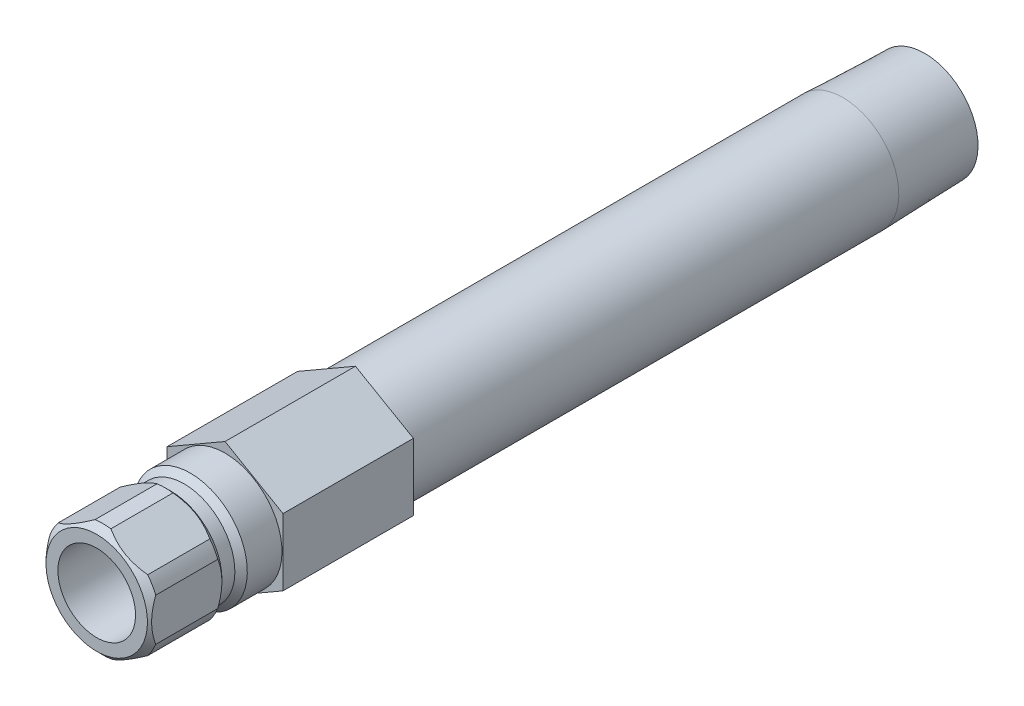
ISO-10303-21;
HEADER;
FILE_DESCRIPTION(('STEP AP214'),'2;1');
FILE_NAME('part.step','',(''),(''),'','','');
FILE_SCHEMA(('AUTOMOTIVE_DESIGN { 1 0 10303 214 1 1 1 1 }'));
ENDSEC;
DATA;
#1=APPLICATION_CONTEXT('core data for automotive mechanical design processes');
#2=APPLICATION_PROTOCOL_DEFINITION('international standard','automotive_design',2000,#1);
#3=PRODUCT_CONTEXT('',#1,'mechanical');
#4=PRODUCT('Part','Part','',(#3));
#5=PRODUCT_RELATED_PRODUCT_CATEGORY('part','',(#4));
#6=PRODUCT_DEFINITION_FORMATION('','',#4);
#7=PRODUCT_DEFINITION_CONTEXT('part definition',#1,'design');
#8=PRODUCT_DEFINITION('design','',#6,#7);
#9=PRODUCT_DEFINITION_SHAPE('','',#8);
#10=(LENGTH_UNIT() NAMED_UNIT(*) SI_UNIT(.MILLI.,.METRE.));
#11=(NAMED_UNIT(*) PLANE_ANGLE_UNIT() SI_UNIT($,.RADIAN.));
#12=(NAMED_UNIT(*) SI_UNIT($,.STERADIAN.) SOLID_ANGLE_UNIT());
#13=UNCERTAINTY_MEASURE_WITH_UNIT(LENGTH_MEASURE(1.E-05),#10,'distance_accuracy_value','');
#14=(GEOMETRIC_REPRESENTATION_CONTEXT(3) GLOBAL_UNCERTAINTY_ASSIGNED_CONTEXT((#13)) GLOBAL_UNIT_ASSIGNED_CONTEXT((#10,
#11,#12)) REPRESENTATION_CONTEXT('',''));
#15=CARTESIAN_POINT('',(0.,0.,0.));
#16=DIRECTION('',(0.,0.,1.));
#17=DIRECTION('',(1.,0.,0.));
#18=AXIS2_PLACEMENT_3D('',#15,#16,#17);
#19=CARTESIAN_POINT('',(0.,0.,12.8748331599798));
#20=DIRECTION('',(0.,0.,-1.));
#21=DIRECTION('',(0.,1.,0.));
#22=AXIS2_PLACEMENT_3D('',#19,#20,#21);
#23=CYLINDRICAL_SURFACE('',#22,6.985);
#24=DIRECTION('',(0.,0.,-1.));
#25=VECTOR('',#24,1.);
#26=CARTESIAN_POINT('',(5.50323442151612,-4.30170151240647,12.8748331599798));
#27=LINE('',#26,#25);
#28=CARTESIAN_POINT('',(5.50323442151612,-4.30170151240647,7.366));
#29=VERTEX_POINT('',#28);
#30=CARTESIAN_POINT('',(5.50323442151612,-4.30170151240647,14.986));
#31=VERTEX_POINT('',#30);
#32=EDGE_CURVE('E452',#29,#31,#27,.F.);
#33=ORIENTED_EDGE('',*,*,#32,.F.);
#34=CARTESIAN_POINT('',(0.,0.,7.366));
#35=DIRECTION('',(0.,0.,-1.));
#36=DIRECTION('',(0.,1.,0.));
#37=AXIS2_PLACEMENT_3D('',#34,#35,#36);
#38=CIRCLE('',#37,6.985);
#39=CARTESIAN_POINT('',(6.477,-2.6150900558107,7.366));
#40=VERTEX_POINT('',#39);
#41=EDGE_CURVE('E190',#40,#29,#38,.T.);
#42=ORIENTED_EDGE('',*,*,#41,.F.);
#43=DIRECTION('',(0.,0.,-1.));
#44=VECTOR('',#43,1.);
#45=CARTESIAN_POINT('',(6.477,-2.6150900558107,12.8748331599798));
#46=LINE('',#45,#44);
#47=CARTESIAN_POINT('',(6.477,-2.6150900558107,14.986));
#48=VERTEX_POINT('',#47);
#49=EDGE_CURVE('E367',#48,#40,#46,.T.);
#50=ORIENTED_EDGE('',*,*,#49,.F.);
#51=CARTESIAN_POINT('',(0.,0.,14.986));
#52=DIRECTION('',(0.,0.,-1.));
#53=DIRECTION('',(0.,1.,0.));
#54=AXIS2_PLACEMENT_3D('',#51,#52,#53);
#55=CIRCLE('',#54,6.985);
#56=EDGE_CURVE('E355',#48,#31,#55,.T.);
#57=ORIENTED_EDGE('',*,*,#56,.T.);
#58=EDGE_LOOP('',(#33,#42,#50,#57));
#59=FACE_BOUND('',#58,.T.);
#60=ADVANCED_FACE('F34',(#59),#23,.T.);
#61=DIRECTION('',(0.,0.,-1.));
#62=VECTOR('',#61,1.);
#63=CARTESIAN_POINT('',(6.477,2.6150900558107,12.8748331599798));
#64=LINE('',#63,#62);
#65=CARTESIAN_POINT('',(6.477,2.6150900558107,7.366));
#66=VERTEX_POINT('',#65);
#67=CARTESIAN_POINT('',(6.477,2.6150900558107,14.986));
#68=VERTEX_POINT('',#67);
#69=EDGE_CURVE('E279',#66,#68,#64,.F.);
#70=ORIENTED_EDGE('',*,*,#69,.F.);
#71=CARTESIAN_POINT('',(5.50323442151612,4.30170151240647,7.366));
#72=VERTEX_POINT('',#71);
#73=EDGE_CURVE('E193',#72,#66,#38,.T.);
#74=ORIENTED_EDGE('',*,*,#73,.F.);
#75=DIRECTION('',(0.,0.,-1.));
#76=VECTOR('',#75,1.);
#77=CARTESIAN_POINT('',(5.50323442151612,4.30170151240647,12.8748331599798));
#78=LINE('',#77,#76);
#79=CARTESIAN_POINT('',(5.50323442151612,4.30170151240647,14.986));
#80=VERTEX_POINT('',#79);
#81=EDGE_CURVE('E351',#80,#72,#78,.T.);
#82=ORIENTED_EDGE('',*,*,#81,.F.);
#83=EDGE_CURVE('E205',#80,#68,#55,.T.);
#84=ORIENTED_EDGE('',*,*,#83,.T.);
#85=EDGE_LOOP('',(#70,#74,#82,#84));
#86=FACE_BOUND('',#85,.T.);
#87=ADVANCED_FACE('F313',(#86),#23,.T.);
#88=DIRECTION('',(0.,0.,-1.));
#89=VECTOR('',#88,1.);
#90=CARTESIAN_POINT('',(0.973765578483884,6.91679156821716,12.8748331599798));
#91=LINE('',#90,#89);
#92=CARTESIAN_POINT('',(0.973765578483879,6.91679156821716,7.366));
#93=VERTEX_POINT('',#92);
#94=CARTESIAN_POINT('',(0.973765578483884,6.91679156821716,14.986));
#95=VERTEX_POINT('',#94);
#96=EDGE_CURVE('E370',#93,#95,#91,.F.);
#97=ORIENTED_EDGE('',*,*,#96,.F.);
#98=CARTESIAN_POINT('',(-0.97376557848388,6.91679156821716,7.366));
#99=VERTEX_POINT('',#98);
#100=EDGE_CURVE('E195',#99,#93,#38,.T.);
#101=ORIENTED_EDGE('',*,*,#100,.F.);
#102=DIRECTION('',(0.,0.,-1.));
#103=VECTOR('',#102,1.);
#104=CARTESIAN_POINT('',(-0.973765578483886,6.91679156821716,12.8748331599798));
#105=LINE('',#104,#103);
#106=CARTESIAN_POINT('',(-0.973765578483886,6.91679156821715,14.986));
#107=VERTEX_POINT('',#106);
#108=EDGE_CURVE('E54',#107,#99,#105,.T.);
#109=ORIENTED_EDGE('',*,*,#108,.F.);
#110=EDGE_CURVE('E201',#107,#95,#55,.T.);
#111=ORIENTED_EDGE('',*,*,#110,.T.);
#112=EDGE_LOOP('',(#97,#101,#109,#111));
#113=FACE_BOUND('',#112,.T.);
#114=ADVANCED_FACE('F318',(#113),#23,.T.);
#115=DIRECTION('',(0.,0.,-1.));
#116=VECTOR('',#115,1.);
#117=CARTESIAN_POINT('',(-5.50323442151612,4.30170151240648,12.8748331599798));
#118=LINE('',#117,#116);
#119=CARTESIAN_POINT('',(-5.50323442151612,4.30170151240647,7.366));
#120=VERTEX_POINT('',#119);
#121=CARTESIAN_POINT('',(-5.50323442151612,4.30170151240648,14.986));
#122=VERTEX_POINT('',#121);
#123=EDGE_CURVE('E349',#120,#122,#118,.F.);
#124=ORIENTED_EDGE('',*,*,#123,.F.);
#125=CARTESIAN_POINT('',(-6.477,2.61509005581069,7.366));
#126=VERTEX_POINT('',#125);
#127=EDGE_CURVE('E194',#126,#120,#38,.T.);
#128=ORIENTED_EDGE('',*,*,#127,.F.);
#129=DIRECTION('',(0.,0.,-1.));
#130=VECTOR('',#129,1.);
#131=CARTESIAN_POINT('',(-6.477,2.61509005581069,12.8748331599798));
#132=LINE('',#131,#130);
#133=CARTESIAN_POINT('',(-6.477,2.61509005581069,14.986));
#134=VERTEX_POINT('',#133);
#135=EDGE_CURVE('E62',#134,#126,#132,.T.);
#136=ORIENTED_EDGE('',*,*,#135,.F.);
#137=EDGE_CURVE('E204',#134,#122,#55,.T.);
#138=ORIENTED_EDGE('',*,*,#137,.T.);
#139=EDGE_LOOP('',(#124,#128,#136,#138));
#140=FACE_BOUND('',#139,.T.);
#141=ADVANCED_FACE('F329',(#140),#23,.T.);
#142=DIRECTION('',(0.,0.,-1.));
#143=VECTOR('',#142,1.);
#144=CARTESIAN_POINT('',(-6.477,-2.61509005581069,12.8748331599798));
#145=LINE('',#144,#143);
#146=CARTESIAN_POINT('',(-6.477,-2.61509005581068,7.366));
#147=VERTEX_POINT('',#146);
#148=CARTESIAN_POINT('',(-6.477,-2.61509005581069,14.986));
#149=VERTEX_POINT('',#148);
#150=EDGE_CURVE('E340',#147,#149,#145,.F.);
#151=ORIENTED_EDGE('',*,*,#150,.F.);
#152=CARTESIAN_POINT('',(-5.50323442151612,-4.30170151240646,7.366));
#153=VERTEX_POINT('',#152);
#154=EDGE_CURVE('E191',#153,#147,#38,.T.);
#155=ORIENTED_EDGE('',*,*,#154,.F.);
#156=DIRECTION('',(0.,0.,-1.));
#157=VECTOR('',#156,1.);
#158=CARTESIAN_POINT('',(-5.50323442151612,-4.30170151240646,12.8748331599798));
#159=LINE('',#158,#157);
#160=CARTESIAN_POINT('',(-5.50323442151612,-4.30170151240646,14.986));
#161=VERTEX_POINT('',#160);
#162=EDGE_CURVE('E168',#161,#153,#159,.T.);
#163=ORIENTED_EDGE('',*,*,#162,.F.);
#164=EDGE_CURVE('E342',#161,#149,#55,.T.);
#165=ORIENTED_EDGE('',*,*,#164,.T.);
#166=EDGE_LOOP('',(#151,#155,#163,#165));
#167=FACE_BOUND('',#166,.T.);
#168=ADVANCED_FACE('F322',(#167),#23,.T.);
#169=CARTESIAN_POINT('',(0.,0.,12.8748331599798));
#170=DIRECTION('',(0.,0.,-1.));
#171=DIRECTION('',(0.,1.,0.));
#172=AXIS2_PLACEMENT_3D('',#169,#170,#171);
#173=CYLINDRICAL_SURFACE('',#172,6.85799999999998);
#174=CARTESIAN_POINT('',(0.,0.,-75.819));
#175=DIRECTION('',(0.,0.,-1.));
#176=DIRECTION('',(0.,1.,0.));
#177=AXIS2_PLACEMENT_3D('',#174,#175,#176);
#178=CIRCLE('',#177,6.85799999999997);
#179=CARTESIAN_POINT('',(0.,6.858,-75.819));
#180=VERTEX_POINT('',#179);
#181=EDGE_CURVE('E520',#180,#180,#178,.T.);
#182=ORIENTED_EDGE('',*,*,#181,.F.);
#183=EDGE_LOOP('',(#182));
#184=FACE_BOUND('',#183,.T.);
#185=CARTESIAN_POINT('',(0.,0.,-16.002));
#186=DIRECTION('',(0.,0.,1.));
#187=DIRECTION('',(1.,0.,0.));
#188=AXIS2_PLACEMENT_3D('',#185,#186,#187);
#189=CIRCLE('',#188,6.85799999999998);
#190=CARTESIAN_POINT('',(6.85799999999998,0.,-16.002));
#191=VERTEX_POINT('',#190);
#192=EDGE_CURVE('E496',#191,#191,#189,.F.);
#193=ORIENTED_EDGE('',*,*,#192,.T.);
#194=EDGE_LOOP('',(#193));
#195=FACE_BOUND('',#194,.T.);
#196=ADVANCED_FACE('F328',(#184,#195),#173,.T.);
#197=CARTESIAN_POINT('',(0.,0.,12.8748331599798));
#198=DIRECTION('',(0.,0.,-1.));
#199=DIRECTION('',(0.,1.,0.));
#200=AXIS2_PLACEMENT_3D('',#197,#198,#199);
#201=CYLINDRICAL_SURFACE('',#200,4.7625);
#202=CARTESIAN_POINT('',(0.,0.,3.556));
#203=DIRECTION('',(0.,0.,-1.));
#204=DIRECTION('',(0.,1.,0.));
#205=AXIS2_PLACEMENT_3D('',#202,#203,#204);
#206=CIRCLE('',#205,4.76249999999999);
#207=CARTESIAN_POINT('',(0.,4.7625,3.556));
#208=VERTEX_POINT('',#207);
#209=EDGE_CURVE('E508',#208,#208,#206,.T.);
#210=ORIENTED_EDGE('',*,*,#209,.T.);
#211=EDGE_LOOP('',(#210));
#212=FACE_BOUND('',#211,.T.);
#213=CARTESIAN_POINT('',(0.,0.,15.748));
#214=DIRECTION('',(0.,0.,-1.));
#215=DIRECTION('',(0.,1.,0.));
#216=AXIS2_PLACEMENT_3D('',#213,#214,#215);
#217=CIRCLE('',#216,4.7625);
#218=CARTESIAN_POINT('',(0.,4.7625,15.748));
#219=VERTEX_POINT('',#218);
#220=EDGE_CURVE('E174',#219,#219,#217,.T.);
#221=ORIENTED_EDGE('',*,*,#220,.F.);
#222=EDGE_LOOP('',(#221));
#223=FACE_BOUND('',#222,.T.);
#224=ADVANCED_FACE('F36',(#212,#223),#201,.F.);
#225=CARTESIAN_POINT('',(0.,4.7625,15.748));
#226=DIRECTION('',(0.,0.,1.));
#227=DIRECTION('',(0.,-1.,0.));
#228=AXIS2_PLACEMENT_3D('',#225,#226,#227);
#229=PLANE('',#228);
#230=ORIENTED_EDGE('',*,*,#220,.T.);
#231=EDGE_LOOP('',(#230));
#232=FACE_BOUND('',#231,.T.);
#233=CARTESIAN_POINT('',(0.,0.,15.748));
#234=DIRECTION('',(0.,0.,-1.));
#235=DIRECTION('',(0.,1.,0.));
#236=AXIS2_PLACEMENT_3D('',#233,#234,#235);
#237=CIRCLE('',#236,6.223);
#238=CARTESIAN_POINT('',(0.,6.223,15.748));
#239=VERTEX_POINT('',#238);
#240=EDGE_CURVE('E206',#239,#239,#237,.T.);
#241=ORIENTED_EDGE('',*,*,#240,.F.);
#242=EDGE_LOOP('',(#241));
#243=FACE_BOUND('',#242,.T.);
#244=ADVANCED_FACE('F241',(#232,#243),#229,.T.);
#245=CARTESIAN_POINT('',(0.,0.,14.986));
#246=DIRECTION('',(0.,0.,-1.));
#247=DIRECTION('',(0.,1.,0.));
#248=AXIS2_PLACEMENT_3D('',#245,#246,#247);
#249=CONICAL_SURFACE('',#248,6.985,0.785398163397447);
#250=CARTESIAN_POINT('',(5.50369701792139,-4.30143443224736,14.9858));
#251=CARTESIAN_POINT('',(5.32269478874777,-4.40593611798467,15.0641166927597));
#252=CARTESIAN_POINT('',(5.13917907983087,-4.51188896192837,15.1353544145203));
#253=CARTESIAN_POINT('',(4.76736839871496,-4.72655395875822,15.2608524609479));
#254=CARTESIAN_POINT('',(4.57906245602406,-4.83527244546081,15.3150691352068));
#255=CARTESIAN_POINT('',(4.20553846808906,-5.05092662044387,15.401724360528));
#256=CARTESIAN_POINT('',(4.02044501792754,-5.15779037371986,15.4348622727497));
#257=CARTESIAN_POINT('',(3.64855359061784,-5.37250198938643,15.4802195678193));
#258=CARTESIAN_POINT('',(3.46175806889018,-5.48034843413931,15.4924653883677));
#259=CARTESIAN_POINT('',(3.08219421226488,-5.69948972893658,15.4953056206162));
#260=CARTESIAN_POINT('',(2.88942157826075,-5.81078706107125,15.4852117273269));
#261=CARTESIAN_POINT('',(2.50551871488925,-6.03243348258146,15.4426708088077));
#262=CARTESIAN_POINT('',(2.31439108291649,-6.14278107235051,15.4101933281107));
#263=CARTESIAN_POINT('',(1.92845877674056,-6.36559919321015,15.3234273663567));
#264=CARTESIAN_POINT('',(1.73378601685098,-6.47799356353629,15.268364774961));
#265=CARTESIAN_POINT('',(1.44558978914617,-6.6443837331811,15.1720079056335));
#266=CARTESIAN_POINT('',(1.35026676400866,-6.69941850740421,15.1376422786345));
#267=CARTESIAN_POINT('',(1.16086120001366,-6.80877186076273,15.0647445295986));
#268=CARTESIAN_POINT('',(1.06677820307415,-6.86309070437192,15.0262139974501));
#269=CARTESIAN_POINT('',(0.973302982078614,-6.91705864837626,14.9858));
#270=B_SPLINE_CURVE_WITH_KNOTS('',3,(#250,#251,#252,#253,#254,#255,#256,#257,#258,#259,#260,
#261,#262,#263,#264,#265,#266,#267,#268,#269),.UNSPECIFIED.,.F.,.F.,(4,2,2,2,2,2,2,2,2,4),(0.,
0.669810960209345,1.34132587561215,1.9892054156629,2.63626449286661,3.30353665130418,
3.97171850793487,4.66502165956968,5.01088265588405,5.35661208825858),.UNSPECIFIED.);
#271=CARTESIAN_POINT('',(0.973765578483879,-6.91679156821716,14.986));
#272=VERTEX_POINT('',#271);
#273=EDGE_CURVE('E451',#31,#272,#270,.T.);
#274=ORIENTED_EDGE('',*,*,#273,.F.);
#275=ORIENTED_EDGE('',*,*,#56,.F.);
#276=CARTESIAN_POINT('',(6.477,-7.50531717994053,12.0573066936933));
#277=CARTESIAN_POINT('',(6.477,-7.32278230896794,12.1954662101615));
#278=CARTESIAN_POINT('',(6.477,-7.13923073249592,12.3323042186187));
#279=CARTESIAN_POINT('',(6.477,-6.76969107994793,12.6027438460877));
#280=CARTESIAN_POINT('',(6.477,-6.58370240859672,12.7363446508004));
#281=CARTESIAN_POINT('',(6.477,-6.20752484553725,13.0006667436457));
#282=CARTESIAN_POINT('',(6.477,-6.01731457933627,13.1313577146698));
#283=CARTESIAN_POINT('',(6.477,-5.63367369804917,13.3879087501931));
#284=CARTESIAN_POINT('',(6.477,-5.44024331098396,13.5137691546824));
#285=CARTESIAN_POINT('',(6.477,-5.03831720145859,13.7667102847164));
#286=CARTESIAN_POINT('',(6.477,-4.8295984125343,13.893438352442));
#287=CARTESIAN_POINT('',(6.477,-4.4072839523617,14.1386241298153));
#288=CARTESIAN_POINT('',(6.477,-4.19368750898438,14.2570805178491));
#289=CARTESIAN_POINT('',(6.477,-3.7616267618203,14.4831715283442));
#290=CARTESIAN_POINT('',(6.477,-3.54317924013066,14.5908379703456));
#291=CARTESIAN_POINT('',(6.477,-3.100295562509,14.7929384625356));
#292=CARTESIAN_POINT('',(6.477,-2.87586219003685,14.8873785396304));
#293=CARTESIAN_POINT('',(6.477,-2.43955826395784,15.0524966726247));
#294=CARTESIAN_POINT('',(6.477,-2.22819339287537,15.1244971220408));
#295=CARTESIAN_POINT('',(6.477,-1.80033354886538,15.2515475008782));
#296=CARTESIAN_POINT('',(6.477,-1.58383822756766,15.3065962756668));
#297=CARTESIAN_POINT('',(6.477,-1.15063390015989,15.3959385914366));
#298=CARTESIAN_POINT('',(6.477,-0.934000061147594,15.4305906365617));
#299=CARTESIAN_POINT('',(6.477,-0.498364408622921,15.4784594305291));
#300=CARTESIAN_POINT('',(6.477,-0.279363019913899,15.4916799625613));
#301=CARTESIAN_POINT('',(6.477,0.150697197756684,15.4956835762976));
#302=CARTESIAN_POINT('',(6.477,0.361748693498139,15.4872823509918));
#303=CARTESIAN_POINT('',(6.477,0.782066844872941,15.4503172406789));
#304=CARTESIAN_POINT('',(6.477,0.991333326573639,15.421751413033));
#305=CARTESIAN_POINT('',(6.477,1.41010575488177,15.3455375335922));
#306=CARTESIAN_POINT('',(6.477,1.6195513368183,15.2975631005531));
#307=CARTESIAN_POINT('',(6.477,2.03387291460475,15.1851046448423));
#308=CARTESIAN_POINT('',(6.477,2.2387492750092,15.1206219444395));
#309=CARTESIAN_POINT('',(6.477,2.66141718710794,14.9715598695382));
#310=CARTESIAN_POINT('',(6.477,2.87875617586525,14.8857103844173));
#311=CARTESIAN_POINT('',(6.477,3.30779766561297,14.7008180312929));
#312=CARTESIAN_POINT('',(6.477,3.51949749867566,14.6017690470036));
#313=CARTESIAN_POINT('',(6.477,3.9382898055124,14.3928329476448));
#314=CARTESIAN_POINT('',(6.477,4.14536521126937,14.282911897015));
#315=CARTESIAN_POINT('',(6.477,4.55475391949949,14.0546596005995));
#316=CARTESIAN_POINT('',(6.477,4.75706796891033,13.93632968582));
#317=CARTESIAN_POINT('',(6.477,5.14761370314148,13.6989609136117));
#318=CARTESIAN_POINT('',(6.477,5.33604552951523,13.580249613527));
#319=CARTESIAN_POINT('',(6.477,5.70967381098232,13.3378251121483));
#320=CARTESIAN_POINT('',(6.477,5.89487001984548,13.2141115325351));
#321=CARTESIAN_POINT('',(6.477,6.26095063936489,12.9635958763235));
#322=CARTESIAN_POINT('',(6.477,6.44185783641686,12.8368269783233));
#323=CARTESIAN_POINT('',(6.477,6.80119835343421,12.5799293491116));
#324=CARTESIAN_POINT('',(6.477,6.97963234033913,12.4498015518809));
#325=CARTESIAN_POINT('',(6.477,7.15703038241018,12.3183002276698));
#326=B_SPLINE_CURVE_WITH_KNOTS('',3,(#276,#277,#278,#279,#280,#281,#282,#283,#284,#285,#286,
#287,#288,#289,#290,#291,#292,#293,#294,#295,#296,#297,#298,#299,#300,#301,#302,#303,#304,#305,
#306,#307,#308,#309,#310,#311,#312,#313,#314,#315,#316,#317,#318,#319,#320,#321,#322,#323,#324,
#325),.UNSPECIFIED.,.F.,.F.,(4,2,2,2,2,2,2,2,2,2,2,2,2,2,2,2,2,2,2,2,2,2,2,2,4),(0.,
0.686790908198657,1.37375281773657,2.06603541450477,2.75826919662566,3.49065471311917,
4.22315698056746,4.95343127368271,5.68337170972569,6.35265989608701,7.02199365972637,
7.67918147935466,8.33625327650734,8.96890298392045,9.6016136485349,10.2454384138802,
10.8892116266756,11.5897073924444,12.2905288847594,12.9936114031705,13.6965828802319,
14.3646145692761,15.0326968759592,15.6953618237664,16.3578444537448),.UNSPECIFIED.);
#327=EDGE_CURVE('E271',#68,#48,#326,.F.);
#328=ORIENTED_EDGE('',*,*,#327,.F.);
#329=ORIENTED_EDGE('',*,*,#83,.F.);
#330=CARTESIAN_POINT('',(0.973302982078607,6.91705864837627,14.9858));
#331=CARTESIAN_POINT('',(1.15430521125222,6.81255696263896,15.0641166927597));
#332=CARTESIAN_POINT('',(1.33782092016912,6.70660411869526,15.1353544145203));
#333=CARTESIAN_POINT('',(1.70963160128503,6.49193912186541,15.2608524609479));
#334=CARTESIAN_POINT('',(1.89793754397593,6.38322063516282,15.3150691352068));
#335=CARTESIAN_POINT('',(2.27146153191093,6.16756646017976,15.401724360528));
#336=CARTESIAN_POINT('',(2.45655498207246,6.06070270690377,15.4348622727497));
#337=CARTESIAN_POINT('',(2.82844640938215,5.8459910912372,15.4802195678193));
#338=CARTESIAN_POINT('',(3.01524193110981,5.73814464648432,15.4924653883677));
#339=CARTESIAN_POINT('',(3.39480578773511,5.51900335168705,15.4953056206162));
#340=CARTESIAN_POINT('',(3.58757842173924,5.40770601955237,15.4852117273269));
#341=CARTESIAN_POINT('',(3.97148128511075,5.18605959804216,15.4426708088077));
#342=CARTESIAN_POINT('',(4.16260891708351,5.07571200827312,15.4101933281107));
#343=CARTESIAN_POINT('',(4.54854122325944,4.85289388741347,15.3234273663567));
#344=CARTESIAN_POINT('',(4.74321398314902,4.74049951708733,15.268364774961));
#345=CARTESIAN_POINT('',(5.03141021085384,4.57410934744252,15.1720079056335));
#346=CARTESIAN_POINT('',(5.12673323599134,4.51907457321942,15.1376422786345));
#347=CARTESIAN_POINT('',(5.31613879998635,4.40972121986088,15.0647445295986));
#348=CARTESIAN_POINT('',(5.41022179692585,4.3554023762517,15.0262139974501));
#349=CARTESIAN_POINT('',(5.50369701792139,4.30143443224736,14.9858));
#350=B_SPLINE_CURVE_WITH_KNOTS('',3,(#330,#331,#332,#333,#334,#335,#336,#337,#338,#339,#340,
#341,#342,#343,#344,#345,#346,#347,#348,#349),.UNSPECIFIED.,.F.,.F.,(4,2,2,2,2,2,2,2,2,4),(0.,
0.669810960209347,1.34132587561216,1.9892054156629,2.63626449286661,3.30353665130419,
3.97171850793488,4.66502165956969,5.01088265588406,5.35661208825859),.UNSPECIFIED.);
#351=EDGE_CURVE('E263',#95,#80,#350,.T.);
#352=ORIENTED_EDGE('',*,*,#351,.F.);
#353=ORIENTED_EDGE('',*,*,#110,.F.);
#354=CARTESIAN_POINT('',(-5.50369701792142,4.30143443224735,14.9858));
#355=CARTESIAN_POINT('',(-5.3226947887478,4.40593611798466,15.0641166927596));
#356=CARTESIAN_POINT('',(-5.1391790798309,4.51188896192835,15.1353544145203));
#357=CARTESIAN_POINT('',(-4.76736839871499,4.72655395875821,15.2608524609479));
#358=CARTESIAN_POINT('',(-4.57906245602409,4.8352724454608,15.3150691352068));
#359=CARTESIAN_POINT('',(-4.20553846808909,5.05092662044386,15.401724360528));
#360=CARTESIAN_POINT('',(-4.02044501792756,5.15779037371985,15.4348622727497));
#361=CARTESIAN_POINT('',(-3.64855359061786,5.37250198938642,15.4802195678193));
#362=CARTESIAN_POINT('',(-3.4617580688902,5.4803484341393,15.4924653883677));
#363=CARTESIAN_POINT('',(-3.0821942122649,5.69948972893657,15.4953056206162));
#364=CARTESIAN_POINT('',(-2.88942157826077,5.81078706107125,15.4852117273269));
#365=CARTESIAN_POINT('',(-2.50551871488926,6.03243348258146,15.4426708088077));
#366=CARTESIAN_POINT('',(-2.3143910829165,6.14278107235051,15.4101933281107));
#367=CARTESIAN_POINT('',(-1.92845877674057,6.36559919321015,15.3234273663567));
#368=CARTESIAN_POINT('',(-1.73378601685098,6.47799356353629,15.268364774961));
#369=CARTESIAN_POINT('',(-1.44558978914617,6.6443837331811,15.1720079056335));
#370=CARTESIAN_POINT('',(-1.35026676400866,6.69941850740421,15.1376422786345));
#371=CARTESIAN_POINT('',(-1.16086120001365,6.80877186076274,15.0647445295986));
#372=CARTESIAN_POINT('',(-1.06677820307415,6.86309070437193,15.0262139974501));
#373=CARTESIAN_POINT('',(-0.97330298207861,6.91705864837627,14.9858));
#374=B_SPLINE_CURVE_WITH_KNOTS('',3,(#354,#355,#356,#357,#358,#359,#360,#361,#362,#363,#364,
#365,#366,#367,#368,#369,#370,#371,#372,#373),.UNSPECIFIED.,.F.,.F.,(4,2,2,2,2,2,2,2,2,4),(0.,
0.66981096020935,1.34132587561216,1.98920541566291,2.63626449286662,3.3035366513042,
3.9717185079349,4.66502165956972,5.01088265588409,5.35661208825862),.UNSPECIFIED.);
#375=EDGE_CURVE('E256',#122,#107,#374,.T.);
#376=ORIENTED_EDGE('',*,*,#375,.F.);
#377=ORIENTED_EDGE('',*,*,#137,.F.);
#378=CARTESIAN_POINT('',(-6.477,-7.50531717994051,12.0573066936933));
#379=CARTESIAN_POINT('',(-6.477,-7.32278230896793,12.1954662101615));
#380=CARTESIAN_POINT('',(-6.477,-7.13923073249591,12.3323042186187));
#381=CARTESIAN_POINT('',(-6.477,-6.76969107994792,12.6027438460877));
#382=CARTESIAN_POINT('',(-6.477,-6.58370240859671,12.7363446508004));
#383=CARTESIAN_POINT('',(-6.477,-6.20752484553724,13.0006667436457));
#384=CARTESIAN_POINT('',(-6.477,-6.01731457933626,13.1313577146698));
#385=CARTESIAN_POINT('',(-6.477,-5.63367369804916,13.3879087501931));
#386=CARTESIAN_POINT('',(-6.477,-5.44024331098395,13.5137691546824));
#387=CARTESIAN_POINT('',(-6.477,-5.03831720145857,13.7667102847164));
#388=CARTESIAN_POINT('',(-6.477,-4.82959841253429,13.8934383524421));
#389=CARTESIAN_POINT('',(-6.477,-4.40728395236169,14.1386241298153));
#390=CARTESIAN_POINT('',(-6.477,-4.19368750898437,14.2570805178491));
#391=CARTESIAN_POINT('',(-6.477,-3.76162676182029,14.4831715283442));
#392=CARTESIAN_POINT('',(-6.477,-3.54317924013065,14.5908379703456));
#393=CARTESIAN_POINT('',(-6.477,-3.10029556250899,14.7929384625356));
#394=CARTESIAN_POINT('',(-6.477,-2.87586219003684,14.8873785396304));
#395=CARTESIAN_POINT('',(-6.477,-2.43955826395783,15.0524966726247));
#396=CARTESIAN_POINT('',(-6.477,-2.22819339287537,15.1244971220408));
#397=CARTESIAN_POINT('',(-6.477,-1.80033354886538,15.2515475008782));
#398=CARTESIAN_POINT('',(-6.477,-1.58383822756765,15.3065962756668));
#399=CARTESIAN_POINT('',(-6.477,-1.15063390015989,15.3959385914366));
#400=CARTESIAN_POINT('',(-6.477,-0.934000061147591,15.4305906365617));
#401=CARTESIAN_POINT('',(-6.477,-0.49836440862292,15.4784594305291));
#402=CARTESIAN_POINT('',(-6.477,-0.279363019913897,15.4916799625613));
#403=CARTESIAN_POINT('',(-6.477,0.150697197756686,15.4956835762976));
#404=CARTESIAN_POINT('',(-6.477,0.361748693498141,15.4872823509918));
#405=CARTESIAN_POINT('',(-6.477,0.782066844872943,15.4503172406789));
#406=CARTESIAN_POINT('',(-6.477,0.991333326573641,15.421751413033));
#407=CARTESIAN_POINT('',(-6.477,1.41010575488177,15.3455375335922));
#408=CARTESIAN_POINT('',(-6.477,1.6195513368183,15.2975631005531));
#409=CARTESIAN_POINT('',(-6.477,2.03387291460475,15.1851046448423));
#410=CARTESIAN_POINT('',(-6.477,2.2387492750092,15.1206219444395));
#411=CARTESIAN_POINT('',(-6.477,2.66141718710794,14.9715598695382));
#412=CARTESIAN_POINT('',(-6.477,2.87875617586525,14.8857103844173));
#413=CARTESIAN_POINT('',(-6.477,3.30779766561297,14.7008180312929));
#414=CARTESIAN_POINT('',(-6.477,3.51949749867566,14.6017690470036));
#415=CARTESIAN_POINT('',(-6.477,3.93828980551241,14.3928329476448));
#416=CARTESIAN_POINT('',(-6.477,4.14536521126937,14.282911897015));
#417=CARTESIAN_POINT('',(-6.477,4.55475391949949,14.0546596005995));
#418=CARTESIAN_POINT('',(-6.477,4.75706796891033,13.93632968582));
#419=CARTESIAN_POINT('',(-6.477,5.14761370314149,13.6989609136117));
#420=CARTESIAN_POINT('',(-6.477,5.33604552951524,13.580249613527));
#421=CARTESIAN_POINT('',(-6.477,5.70967381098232,13.3378251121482));
#422=CARTESIAN_POINT('',(-6.477,5.89487001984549,13.2141115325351));
#423=CARTESIAN_POINT('',(-6.477,6.2609506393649,12.9635958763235));
#424=CARTESIAN_POINT('',(-6.477,6.44185783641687,12.8368269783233));
#425=CARTESIAN_POINT('',(-6.477,6.80119835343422,12.5799293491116));
#426=CARTESIAN_POINT('',(-6.477,6.97963234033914,12.4498015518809));
#427=CARTESIAN_POINT('',(-6.477,7.15703038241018,12.3183002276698));
#428=B_SPLINE_CURVE_WITH_KNOTS('',3,(#378,#379,#380,#381,#382,#383,#384,#385,#386,#387,#388,
#389,#390,#391,#392,#393,#394,#395,#396,#397,#398,#399,#400,#401,#402,#403,#404,#405,#406,#407,
#408,#409,#410,#411,#412,#413,#414,#415,#416,#417,#418,#419,#420,#421,#422,#423,#424,#425,#426,
#427),.UNSPECIFIED.,.F.,.F.,(4,2,2,2,2,2,2,2,2,2,2,2,2,2,2,2,2,2,2,2,2,2,2,2,4),(0.,
0.686790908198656,1.37375281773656,2.06603541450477,2.75826919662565,3.49065471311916,
4.22315698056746,4.9534312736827,5.68337170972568,6.352659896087,7.02199365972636,
7.67918147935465,8.33625327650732,8.96890298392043,9.60161364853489,10.2454384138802,
10.8892116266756,11.5897073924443,12.2905288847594,12.9936114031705,13.6965828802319,
14.3646145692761,15.0326968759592,15.6953618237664,16.3578444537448),.UNSPECIFIED.);
#429=EDGE_CURVE('E249',#149,#134,#428,.T.);
#430=ORIENTED_EDGE('',*,*,#429,.F.);
#431=ORIENTED_EDGE('',*,*,#164,.F.);
#432=CARTESIAN_POINT('',(-0.973302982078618,-6.91705864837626,14.9858));
#433=CARTESIAN_POINT('',(-1.15430521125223,-6.81255696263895,15.0641166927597));
#434=CARTESIAN_POINT('',(-1.33782092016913,-6.70660411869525,15.1353544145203));
#435=CARTESIAN_POINT('',(-1.70963160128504,-6.49193912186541,15.2608524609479));
#436=CARTESIAN_POINT('',(-1.89793754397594,-6.38322063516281,15.3150691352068));
#437=CARTESIAN_POINT('',(-2.27146153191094,-6.16756646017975,15.401724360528));
#438=CARTESIAN_POINT('',(-2.45655498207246,-6.06070270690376,15.4348622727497));
#439=CARTESIAN_POINT('',(-2.82844640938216,-5.84599109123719,15.4802195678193));
#440=CARTESIAN_POINT('',(-3.01524193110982,-5.73814464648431,15.4924653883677));
#441=CARTESIAN_POINT('',(-3.39480578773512,-5.51900335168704,15.4953056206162));
#442=CARTESIAN_POINT('',(-3.58757842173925,-5.40770601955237,15.4852117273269));
#443=CARTESIAN_POINT('',(-3.97148128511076,-5.18605959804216,15.4426708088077));
#444=CARTESIAN_POINT('',(-4.16260891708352,-5.07571200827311,15.4101933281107));
#445=CARTESIAN_POINT('',(-4.54854122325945,-4.85289388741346,15.3234273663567));
#446=CARTESIAN_POINT('',(-4.74321398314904,-4.74049951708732,15.268364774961));
#447=CARTESIAN_POINT('',(-5.03141021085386,-4.57410934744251,15.1720079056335));
#448=CARTESIAN_POINT('',(-5.12673323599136,-4.5190745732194,15.1376422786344));
#449=CARTESIAN_POINT('',(-5.31613879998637,-4.40972121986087,15.0647445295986));
#450=CARTESIAN_POINT('',(-5.41022179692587,-4.35540237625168,15.0262139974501));
#451=CARTESIAN_POINT('',(-5.50369701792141,-4.30143443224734,14.9858));
#452=B_SPLINE_CURVE_WITH_KNOTS('',3,(#432,#433,#434,#435,#436,#437,#438,#439,#440,#441,#442,
#443,#444,#445,#446,#447,#448,#449,#450,#451),.UNSPECIFIED.,.F.,.F.,(4,2,2,2,2,2,2,2,2,4),(0.,
0.669810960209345,1.34132587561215,1.9892054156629,2.6362644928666,3.30353665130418,
3.97171850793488,4.6650216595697,5.01088265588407,5.35661208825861),.UNSPECIFIED.);
#453=CARTESIAN_POINT('',(-0.973765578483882,-6.91679156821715,14.986));
#454=VERTEX_POINT('',#453);
#455=EDGE_CURVE('E184',#454,#161,#452,.T.);
#456=ORIENTED_EDGE('',*,*,#455,.F.);
#457=EDGE_CURVE('E183',#272,#454,#55,.T.);
#458=ORIENTED_EDGE('',*,*,#457,.F.);
#459=EDGE_LOOP('',(#274,#275,#328,#329,#352,#353,#376,#377,#430,#431,#456,#458));
#460=FACE_BOUND('',#459,.T.);
#461=ORIENTED_EDGE('',*,*,#240,.T.);
#462=EDGE_LOOP('',(#461));
#463=FACE_BOUND('',#462,.T.);
#464=ADVANCED_FACE('F238',(#460,#463),#249,.T.);
#465=DIRECTION('',(0.,0.,-1.));
#466=VECTOR('',#465,1.);
#467=CARTESIAN_POINT('',(0.973765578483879,-6.91679156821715,12.8748331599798));
#468=LINE('',#467,#466);
#469=CARTESIAN_POINT('',(0.973765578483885,-6.91679156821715,7.366));
#470=VERTEX_POINT('',#469);
#471=EDGE_CURVE('E278',#272,#470,#468,.T.);
#472=ORIENTED_EDGE('',*,*,#471,.F.);
#473=ORIENTED_EDGE('',*,*,#457,.T.);
#474=DIRECTION('',(0.,0.,-1.));
#475=VECTOR('',#474,1.);
#476=CARTESIAN_POINT('',(-0.973765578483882,-6.91679156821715,12.8748331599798));
#477=LINE('',#476,#475);
#478=CARTESIAN_POINT('',(-0.973765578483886,-6.91679156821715,7.366));
#479=VERTEX_POINT('',#478);
#480=EDGE_CURVE('E165',#479,#454,#477,.F.);
#481=ORIENTED_EDGE('',*,*,#480,.F.);
#482=EDGE_CURVE('E181',#470,#479,#38,.T.);
#483=ORIENTED_EDGE('',*,*,#482,.F.);
#484=EDGE_LOOP('',(#472,#473,#481,#483));
#485=FACE_BOUND('',#484,.T.);
#486=ADVANCED_FACE('F180',(#485),#23,.T.);
#487=CARTESIAN_POINT('',(0.,0.,6.604));
#488=DIRECTION('',(0.,0.,1.));
#489=DIRECTION('',(0.,-1.,0.));
#490=AXIS2_PLACEMENT_3D('',#487,#488,#489);
#491=CONICAL_SURFACE('',#490,6.223,0.785398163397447);
#492=CARTESIAN_POINT('',(0.973302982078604,-6.91705864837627,7.3662));
#493=CARTESIAN_POINT('',(1.15430521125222,-6.81255696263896,7.28788330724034));
#494=CARTESIAN_POINT('',(1.33782092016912,-6.70660411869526,7.21664558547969));
#495=CARTESIAN_POINT('',(1.70963160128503,-6.49193912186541,7.09114753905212));
#496=CARTESIAN_POINT('',(1.89793754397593,-6.38322063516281,7.03693086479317));
#497=CARTESIAN_POINT('',(2.27146153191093,-6.16756646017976,6.95027563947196));
#498=CARTESIAN_POINT('',(2.45655498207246,-6.06070270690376,6.91713772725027));
#499=CARTESIAN_POINT('',(2.82844640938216,-5.8459910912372,6.87178043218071));
#500=CARTESIAN_POINT('',(3.01524193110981,-5.73814464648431,6.85953461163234));
#501=CARTESIAN_POINT('',(3.39480578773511,-5.51900335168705,6.85669437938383));
#502=CARTESIAN_POINT('',(3.58757842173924,-5.40770601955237,6.86678827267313));
#503=CARTESIAN_POINT('',(3.97148128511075,-5.18605959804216,6.9093291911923));
#504=CARTESIAN_POINT('',(4.16260891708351,-5.07571200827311,6.9418066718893));
#505=CARTESIAN_POINT('',(4.54854122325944,-4.85289388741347,7.02857263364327));
#506=CARTESIAN_POINT('',(4.74321398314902,-4.74049951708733,7.08363522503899));
#507=CARTESIAN_POINT('',(5.03141021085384,-4.57410934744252,7.17999209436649));
#508=CARTESIAN_POINT('',(5.12673323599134,-4.51907457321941,7.21435772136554));
#509=CARTESIAN_POINT('',(5.31613879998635,-4.40972121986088,7.28725547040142));
#510=CARTESIAN_POINT('',(5.41022179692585,-4.35540237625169,7.32578600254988));
#511=CARTESIAN_POINT('',(5.50369701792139,-4.30143443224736,7.3662));
#512=B_SPLINE_CURVE_WITH_KNOTS('',3,(#492,#493,#494,#495,#496,#497,#498,#499,#500,#501,#502,
#503,#504,#505,#506,#507,#508,#509,#510,#511),.UNSPECIFIED.,.F.,.F.,(4,2,2,2,2,2,2,2,2,4),(0.,
0.669810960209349,1.34132587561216,1.9892054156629,2.63626449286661,3.30353665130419,
3.97171850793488,4.6650216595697,5.01088265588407,5.3566120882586),.UNSPECIFIED.);
#513=EDGE_CURVE('E12',#470,#29,#512,.T.);
#514=ORIENTED_EDGE('',*,*,#513,.F.);
#515=ORIENTED_EDGE('',*,*,#482,.T.);
#516=CARTESIAN_POINT('',(-5.50369701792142,-4.30143443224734,7.36620000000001));
#517=CARTESIAN_POINT('',(-5.32269478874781,-4.40593611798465,7.28788330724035));
#518=CARTESIAN_POINT('',(-5.13917907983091,-4.51188896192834,7.2166455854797));
#519=CARTESIAN_POINT('',(-4.767368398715,-4.7265539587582,7.09114753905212));
#520=CARTESIAN_POINT('',(-4.57906245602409,-4.83527244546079,7.03693086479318));
#521=CARTESIAN_POINT('',(-4.20553846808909,-5.05092662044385,6.95027563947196));
#522=CARTESIAN_POINT('',(-4.02044501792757,-5.15779037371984,6.91713772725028));
#523=CARTESIAN_POINT('',(-3.64855359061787,-5.37250198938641,6.87178043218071));
#524=CARTESIAN_POINT('',(-3.46175806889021,-5.48034843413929,6.85953461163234));
#525=CARTESIAN_POINT('',(-3.08219421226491,-5.69948972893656,6.85669437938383));
#526=CARTESIAN_POINT('',(-2.88942157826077,-5.81078706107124,6.86678827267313));
#527=CARTESIAN_POINT('',(-2.50551871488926,-6.03243348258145,6.9093291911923));
#528=CARTESIAN_POINT('',(-2.3143910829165,-6.1427810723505,6.9418066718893));
#529=CARTESIAN_POINT('',(-1.92845877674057,-6.36559919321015,7.02857263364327));
#530=CARTESIAN_POINT('',(-1.73378601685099,-6.47799356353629,7.08363522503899));
#531=CARTESIAN_POINT('',(-1.44558978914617,-6.6443837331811,7.17999209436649));
#532=CARTESIAN_POINT('',(-1.35026676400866,-6.69941850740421,7.21435772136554));
#533=CARTESIAN_POINT('',(-1.16086120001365,-6.80877186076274,7.28725547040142));
#534=CARTESIAN_POINT('',(-1.06677820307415,-6.86309070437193,7.32578600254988));
#535=CARTESIAN_POINT('',(-0.97330298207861,-6.91705864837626,7.3662));
#536=B_SPLINE_CURVE_WITH_KNOTS('',3,(#516,#517,#518,#519,#520,#521,#522,#523,#524,#525,#526,
#527,#528,#529,#530,#531,#532,#533,#534,#535),.UNSPECIFIED.,.F.,.F.,(4,2,2,2,2,2,2,2,2,4),(0.,
0.669810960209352,1.34132587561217,1.98920541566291,2.63626449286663,3.30353665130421,
3.9717185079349,4.66502165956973,5.0108826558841,5.35661208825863),.UNSPECIFIED.);
#537=EDGE_CURVE('E162',#153,#479,#536,.T.);
#538=ORIENTED_EDGE('',*,*,#537,.F.);
#539=ORIENTED_EDGE('',*,*,#154,.T.);
#540=CARTESIAN_POINT('',(-6.477,-7.50531717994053,10.2946933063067));
#541=CARTESIAN_POINT('',(-6.477,-7.32278230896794,10.1565337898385));
#542=CARTESIAN_POINT('',(-6.477,-7.13923073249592,10.0196957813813));
#543=CARTESIAN_POINT('',(-6.477,-6.76969107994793,9.74925615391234));
#544=CARTESIAN_POINT('',(-6.477,-6.58370240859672,9.61565534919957));
#545=CARTESIAN_POINT('',(-6.477,-6.20752484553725,9.35133325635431));
#546=CARTESIAN_POINT('',(-6.477,-6.01731457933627,9.22064228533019));
#547=CARTESIAN_POINT('',(-6.477,-5.63367369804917,8.96409124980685));
#548=CARTESIAN_POINT('',(-6.477,-5.44024331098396,8.83823084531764));
#549=CARTESIAN_POINT('',(-6.477,-5.03831720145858,8.58528971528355));
#550=CARTESIAN_POINT('',(-6.477,-4.8295984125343,8.45856164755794));
#551=CARTESIAN_POINT('',(-6.477,-4.4072839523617,8.21337587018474));
#552=CARTESIAN_POINT('',(-6.477,-4.19368750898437,8.09491948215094));
#553=CARTESIAN_POINT('',(-6.477,-3.7616267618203,7.8688284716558));
#554=CARTESIAN_POINT('',(-6.477,-3.54317924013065,7.76116202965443));
#555=CARTESIAN_POINT('',(-6.477,-3.100295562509,7.55906153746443));
#556=CARTESIAN_POINT('',(-6.477,-2.87586219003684,7.46462146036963));
#557=CARTESIAN_POINT('',(-6.477,-2.43955826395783,7.2995033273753));
#558=CARTESIAN_POINT('',(-6.477,-2.22819339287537,7.2275028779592));
#559=CARTESIAN_POINT('',(-6.477,-1.80033354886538,7.1004524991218));
#560=CARTESIAN_POINT('',(-6.477,-1.58383822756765,7.0454037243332));
#561=CARTESIAN_POINT('',(-6.477,-1.15063390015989,6.95606140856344));
#562=CARTESIAN_POINT('',(-6.477,-0.934000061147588,6.9214093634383));
#563=CARTESIAN_POINT('',(-6.477,-0.498364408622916,6.87354056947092));
#564=CARTESIAN_POINT('',(-6.477,-0.279363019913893,6.86032003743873));
#565=CARTESIAN_POINT('',(-6.477,0.15069719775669,6.85631642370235));
#566=CARTESIAN_POINT('',(-6.477,0.361748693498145,6.86471764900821));
#567=CARTESIAN_POINT('',(-6.477,0.782066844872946,6.90168275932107));
#568=CARTESIAN_POINT('',(-6.477,0.991333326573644,6.93024858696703));
#569=CARTESIAN_POINT('',(-6.477,1.41010575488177,7.00646246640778));
#570=CARTESIAN_POINT('',(-6.477,1.61955133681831,7.05443689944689));
#571=CARTESIAN_POINT('',(-6.477,2.03387291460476,7.16689535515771));
#572=CARTESIAN_POINT('',(-6.477,2.23874927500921,7.2313780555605));
#573=CARTESIAN_POINT('',(-6.477,2.66141718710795,7.38044013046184));
#574=CARTESIAN_POINT('',(-6.477,2.87875617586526,7.46628961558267));
#575=CARTESIAN_POINT('',(-6.477,3.30779766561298,7.65118196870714));
#576=CARTESIAN_POINT('',(-6.477,3.51949749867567,7.75023095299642));
#577=CARTESIAN_POINT('',(-6.477,3.93828980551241,7.95916705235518));
#578=CARTESIAN_POINT('',(-6.477,4.14536521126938,8.06908810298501));
#579=CARTESIAN_POINT('',(-6.477,4.5547539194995,8.2973403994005));
#580=CARTESIAN_POINT('',(-6.477,4.75706796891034,8.41567031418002));
#581=CARTESIAN_POINT('',(-6.477,5.1476137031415,8.65303908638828));
#582=CARTESIAN_POINT('',(-6.477,5.33604552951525,8.77175038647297));
#583=CARTESIAN_POINT('',(-6.477,5.70967381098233,9.01417488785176));
#584=CARTESIAN_POINT('',(-6.477,5.8948700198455,9.13788846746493));
#585=CARTESIAN_POINT('',(-6.477,6.26095063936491,9.38840412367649));
#586=CARTESIAN_POINT('',(-6.477,6.44185783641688,9.51517302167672));
#587=CARTESIAN_POINT('',(-6.477,6.80119835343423,9.7720706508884));
#588=CARTESIAN_POINT('',(-6.477,6.97963234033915,9.90219844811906));
#589=CARTESIAN_POINT('',(-6.477,7.1570303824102,10.0336997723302));
#590=B_SPLINE_CURVE_WITH_KNOTS('',3,(#540,#541,#542,#543,#544,#545,#546,#547,#548,#549,#550,
#551,#552,#553,#554,#555,#556,#557,#558,#559,#560,#561,#562,#563,#564,#565,#566,#567,#568,#569,
#570,#571,#572,#573,#574,#575,#576,#577,#578,#579,#580,#581,#582,#583,#584,#585,#586,#587,#588,
#589),.UNSPECIFIED.,.F.,.F.,(4,2,2,2,2,2,2,2,2,2,2,2,2,2,2,2,2,2,2,2,2,2,2,2,4),(0.,
0.68679090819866,1.37375281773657,2.06603541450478,2.75826919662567,3.49065471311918,
4.22315698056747,4.95343127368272,5.68337170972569,6.35265989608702,7.02199365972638,
7.67918147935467,8.33625327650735,8.96890298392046,9.60161364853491,10.2454384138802,
10.8892116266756,11.5897073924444,12.2905288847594,12.9936114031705,13.6965828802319,
14.3646145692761,15.0326968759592,15.6953618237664,16.3578444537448),.UNSPECIFIED.);
#591=EDGE_CURVE('E173',#126,#147,#590,.F.);
#592=ORIENTED_EDGE('',*,*,#591,.F.);
#593=ORIENTED_EDGE('',*,*,#127,.T.);
#594=CARTESIAN_POINT('',(-0.97330298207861,6.91705864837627,7.3662));
#595=CARTESIAN_POINT('',(-1.15430521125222,6.81255696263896,7.28788330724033));
#596=CARTESIAN_POINT('',(-1.33782092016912,6.70660411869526,7.21664558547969));
#597=CARTESIAN_POINT('',(-1.70963160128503,6.49193912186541,7.09114753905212));
#598=CARTESIAN_POINT('',(-1.89793754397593,6.38322063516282,7.03693086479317));
#599=CARTESIAN_POINT('',(-2.27146153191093,6.16756646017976,6.95027563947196));
#600=CARTESIAN_POINT('',(-2.45655498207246,6.06070270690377,6.91713772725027));
#601=CARTESIAN_POINT('',(-2.82844640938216,5.8459910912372,6.87178043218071));
#602=CARTESIAN_POINT('',(-3.01524193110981,5.73814464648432,6.85953461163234));
#603=CARTESIAN_POINT('',(-3.39480578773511,5.51900335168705,6.85669437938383));
#604=CARTESIAN_POINT('',(-3.58757842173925,5.40770601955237,6.86678827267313));
#605=CARTESIAN_POINT('',(-3.97148128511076,5.18605959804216,6.9093291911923));
#606=CARTESIAN_POINT('',(-4.16260891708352,5.07571200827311,6.9418066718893));
#607=CARTESIAN_POINT('',(-4.54854122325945,4.85289388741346,7.02857263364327));
#608=CARTESIAN_POINT('',(-4.74321398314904,4.74049951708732,7.083635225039));
#609=CARTESIAN_POINT('',(-5.03141021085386,4.57410934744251,7.1799920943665));
#610=CARTESIAN_POINT('',(-5.12673323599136,4.51907457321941,7.21435772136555));
#611=CARTESIAN_POINT('',(-5.31613879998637,4.40972121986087,7.28725547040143));
#612=CARTESIAN_POINT('',(-5.41022179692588,4.35540237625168,7.32578600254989));
#613=CARTESIAN_POINT('',(-5.50369701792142,4.30143443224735,7.36620000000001));
#614=B_SPLINE_CURVE_WITH_KNOTS('',3,(#594,#595,#596,#597,#598,#599,#600,#601,#602,#603,#604,
#605,#606,#607,#608,#609,#610,#611,#612,#613),.UNSPECIFIED.,.F.,.F.,(4,2,2,2,2,2,2,2,2,4),(0.,
0.669810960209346,1.34132587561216,1.9892054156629,2.63626449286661,3.30353665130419,
3.97171850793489,4.66502165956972,5.01088265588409,5.35661208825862),.UNSPECIFIED.);
#615=EDGE_CURVE('E299',#99,#120,#614,.T.);
#616=ORIENTED_EDGE('',*,*,#615,.F.);
#617=ORIENTED_EDGE('',*,*,#100,.T.);
#618=CARTESIAN_POINT('',(5.50369701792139,4.30143443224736,7.3662));
#619=CARTESIAN_POINT('',(5.32269478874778,4.40593611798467,7.28788330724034));
#620=CARTESIAN_POINT('',(5.13917907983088,4.51188896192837,7.21664558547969));
#621=CARTESIAN_POINT('',(4.76736839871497,4.72655395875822,7.09114753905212));
#622=CARTESIAN_POINT('',(4.57906245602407,4.83527244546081,7.03693086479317));
#623=CARTESIAN_POINT('',(4.20553846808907,5.05092662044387,6.95027563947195));
#624=CARTESIAN_POINT('',(4.02044501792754,5.15779037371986,6.91713772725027));
#625=CARTESIAN_POINT('',(3.64855359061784,5.37250198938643,6.87178043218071));
#626=CARTESIAN_POINT('',(3.46175806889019,5.48034843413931,6.85953461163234));
#627=CARTESIAN_POINT('',(3.08219421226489,5.69948972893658,6.85669437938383));
#628=CARTESIAN_POINT('',(2.88942157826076,5.81078706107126,6.86678827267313));
#629=CARTESIAN_POINT('',(2.50551871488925,6.03243348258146,6.9093291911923));
#630=CARTESIAN_POINT('',(2.31439108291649,6.14278107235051,6.9418066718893));
#631=CARTESIAN_POINT('',(1.92845877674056,6.36559919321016,7.02857263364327));
#632=CARTESIAN_POINT('',(1.73378601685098,6.4779935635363,7.08363522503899));
#633=CARTESIAN_POINT('',(1.44558978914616,6.64438373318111,7.17999209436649));
#634=CARTESIAN_POINT('',(1.35026676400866,6.69941850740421,7.21435772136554));
#635=CARTESIAN_POINT('',(1.16086120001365,6.80877186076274,7.28725547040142));
#636=CARTESIAN_POINT('',(1.06677820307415,6.86309070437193,7.32578600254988));
#637=CARTESIAN_POINT('',(0.973302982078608,6.91705864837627,7.3662));
#638=B_SPLINE_CURVE_WITH_KNOTS('',3,(#618,#619,#620,#621,#622,#623,#624,#625,#626,#627,#628,
#629,#630,#631,#632,#633,#634,#635,#636,#637),.UNSPECIFIED.,.F.,.F.,(4,2,2,2,2,2,2,2,2,4),(0.,
0.669810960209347,1.34132587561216,1.9892054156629,2.63626449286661,3.30353665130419,
3.97171850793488,4.66502165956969,5.01088265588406,5.35661208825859),.UNSPECIFIED.);
#639=EDGE_CURVE('E295',#72,#93,#638,.T.);
#640=ORIENTED_EDGE('',*,*,#639,.F.);
#641=ORIENTED_EDGE('',*,*,#73,.T.);
#642=CARTESIAN_POINT('',(6.477,-7.50531717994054,10.2946933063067));
#643=CARTESIAN_POINT('',(6.477,-7.32278230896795,10.1565337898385));
#644=CARTESIAN_POINT('',(6.477,-7.13923073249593,10.0196957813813));
#645=CARTESIAN_POINT('',(6.477,-6.76969107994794,9.74925615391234));
#646=CARTESIAN_POINT('',(6.477,-6.58370240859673,9.61565534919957));
#647=CARTESIAN_POINT('',(6.477,-6.20752484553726,9.35133325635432));
#648=CARTESIAN_POINT('',(6.477,-6.01731457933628,9.22064228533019));
#649=CARTESIAN_POINT('',(6.477,-5.63367369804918,8.96409124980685));
#650=CARTESIAN_POINT('',(6.477,-5.44024331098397,8.83823084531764));
#651=CARTESIAN_POINT('',(6.477,-5.03831720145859,8.58528971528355));
#652=CARTESIAN_POINT('',(6.477,-4.82959841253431,8.45856164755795));
#653=CARTESIAN_POINT('',(6.477,-4.4072839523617,8.21337587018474));
#654=CARTESIAN_POINT('',(6.477,-4.19368750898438,8.09491948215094));
#655=CARTESIAN_POINT('',(6.477,-3.76162676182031,7.8688284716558));
#656=CARTESIAN_POINT('',(6.477,-3.54317924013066,7.76116202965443));
#657=CARTESIAN_POINT('',(6.477,-3.100295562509,7.55906153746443));
#658=CARTESIAN_POINT('',(6.477,-2.87586219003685,7.46462146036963));
#659=CARTESIAN_POINT('',(6.477,-2.43955826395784,7.2995033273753));
#660=CARTESIAN_POINT('',(6.477,-2.22819339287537,7.2275028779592));
#661=CARTESIAN_POINT('',(6.477,-1.80033354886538,7.10045249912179));
#662=CARTESIAN_POINT('',(6.477,-1.58383822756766,7.0454037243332));
#663=CARTESIAN_POINT('',(6.477,-1.15063390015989,6.95606140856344));
#664=CARTESIAN_POINT('',(6.477,-0.934000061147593,6.92140936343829));
#665=CARTESIAN_POINT('',(6.477,-0.498364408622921,6.87354056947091));
#666=CARTESIAN_POINT('',(6.477,-0.279363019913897,6.86032003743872));
#667=CARTESIAN_POINT('',(6.477,0.150697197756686,6.85631642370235));
#668=CARTESIAN_POINT('',(6.477,0.361748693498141,6.8647176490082));
#669=CARTESIAN_POINT('',(6.477,0.782066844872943,6.90168275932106));
#670=CARTESIAN_POINT('',(6.477,0.991333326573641,6.93024858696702));
#671=CARTESIAN_POINT('',(6.477,1.41010575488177,7.00646246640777));
#672=CARTESIAN_POINT('',(6.477,1.6195513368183,7.05443689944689));
#673=CARTESIAN_POINT('',(6.477,2.03387291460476,7.16689535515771));
#674=CARTESIAN_POINT('',(6.477,2.23874927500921,7.2313780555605));
#675=CARTESIAN_POINT('',(6.477,2.66141718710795,7.38044013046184));
#676=CARTESIAN_POINT('',(6.477,2.87875617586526,7.46628961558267));
#677=CARTESIAN_POINT('',(6.477,3.30779766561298,7.65118196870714));
#678=CARTESIAN_POINT('',(6.477,3.51949749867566,7.75023095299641));
#679=CARTESIAN_POINT('',(6.477,3.93828980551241,7.95916705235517));
#680=CARTESIAN_POINT('',(6.477,4.14536521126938,8.06908810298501));
#681=CARTESIAN_POINT('',(6.477,4.55475391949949,8.29734039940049));
#682=CARTESIAN_POINT('',(6.477,4.75706796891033,8.41567031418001));
#683=CARTESIAN_POINT('',(6.477,5.14761370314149,8.65303908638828));
#684=CARTESIAN_POINT('',(6.477,5.33604552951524,8.77175038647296));
#685=CARTESIAN_POINT('',(6.477,5.70967381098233,9.01417488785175));
#686=CARTESIAN_POINT('',(6.477,5.89487001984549,9.13788846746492));
#687=CARTESIAN_POINT('',(6.477,6.2609506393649,9.38840412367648));
#688=CARTESIAN_POINT('',(6.477,6.44185783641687,9.51517302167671));
#689=CARTESIAN_POINT('',(6.477,6.80119835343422,9.77207065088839));
#690=CARTESIAN_POINT('',(6.477,6.97963234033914,9.90219844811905));
#691=CARTESIAN_POINT('',(6.477,7.15703038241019,10.0336997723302));
#692=B_SPLINE_CURVE_WITH_KNOTS('',3,(#642,#643,#644,#645,#646,#647,#648,#649,#650,#651,#652,
#653,#654,#655,#656,#657,#658,#659,#660,#661,#662,#663,#664,#665,#666,#667,#668,#669,#670,#671,
#672,#673,#674,#675,#676,#677,#678,#679,#680,#681,#682,#683,#684,#685,#686,#687,#688,#689,#690,
#691),.UNSPECIFIED.,.F.,.F.,(4,2,2,2,2,2,2,2,2,2,2,2,2,2,2,2,2,2,2,2,2,2,2,2,4),(0.,
0.686790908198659,1.37375281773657,2.06603541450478,2.75826919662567,3.49065471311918,
4.22315698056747,4.95343127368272,5.6833717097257,6.35265989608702,7.02199365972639,
7.67918147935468,8.33625327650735,8.96890298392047,9.60161364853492,10.2454384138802,
10.8892116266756,11.5897073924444,12.2905288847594,12.9936114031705,13.6965828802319,
14.3646145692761,15.0326968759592,15.6953618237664,16.3578444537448),.UNSPECIFIED.);
#693=EDGE_CURVE('E47',#40,#66,#692,.T.);
#694=ORIENTED_EDGE('',*,*,#693,.F.);
#695=ORIENTED_EDGE('',*,*,#41,.T.);
#696=EDGE_LOOP('',(#514,#515,#538,#539,#592,#593,#616,#617,#640,#641,#694,#695));
#697=FACE_BOUND('',#696,.T.);
#698=CARTESIAN_POINT('',(0.,0.,6.604));
#699=DIRECTION('',(0.,0.,-1.));
#700=DIRECTION('',(0.,1.,0.));
#701=AXIS2_PLACEMENT_3D('',#698,#699,#700);
#702=CIRCLE('',#701,6.223);
#703=CARTESIAN_POINT('',(0.,6.223,6.604));
#704=VERTEX_POINT('',#703);
#705=EDGE_CURVE('E199',#704,#704,#702,.T.);
#706=ORIENTED_EDGE('',*,*,#705,.F.);
#707=EDGE_LOOP('',(#706));
#708=FACE_BOUND('',#707,.T.);
#709=ADVANCED_FACE('F187',(#697,#708),#491,.T.);
#710=CARTESIAN_POINT('',(0.,0.,12.8748331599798));
#711=DIRECTION('',(0.,0.,-1.));
#712=DIRECTION('',(0.,1.,0.));
#713=AXIS2_PLACEMENT_3D('',#710,#711,#712);
#714=CYLINDRICAL_SURFACE('',#713,6.223);
#715=ORIENTED_EDGE('',*,*,#705,.T.);
#716=EDGE_LOOP('',(#715));
#717=FACE_BOUND('',#716,.T.);
#718=CARTESIAN_POINT('',(0.,0.,5.0165));
#719=DIRECTION('',(0.,0.,-1.));
#720=DIRECTION('',(0.,1.,0.));
#721=AXIS2_PLACEMENT_3D('',#718,#719,#720);
#722=CIRCLE('',#721,6.223);
#723=CARTESIAN_POINT('',(0.,6.223,5.0165));
#724=VERTEX_POINT('',#723);
#725=EDGE_CURVE('E528',#724,#724,#722,.T.);
#726=ORIENTED_EDGE('',*,*,#725,.F.);
#727=EDGE_LOOP('',(#726));
#728=FACE_BOUND('',#727,.T.);
#729=ADVANCED_FACE('F326',(#717,#728),#714,.T.);
#730=CARTESIAN_POINT('',(0.,0.,4.25449999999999));
#731=DIRECTION('',(0.,0.,-1.));
#732=DIRECTION('',(0.,1.,0.));
#733=AXIS2_PLACEMENT_3D('',#730,#731,#732);
#734=CONICAL_SURFACE('',#733,6.985,0.785398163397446);
#735=ORIENTED_EDGE('',*,*,#725,.T.);
#736=EDGE_LOOP('',(#735));
#737=FACE_BOUND('',#736,.T.);
#738=CARTESIAN_POINT('',(0.,0.,4.25449999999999));
#739=DIRECTION('',(0.,0.,-1.));
#740=DIRECTION('',(0.,1.,0.));
#741=AXIS2_PLACEMENT_3D('',#738,#739,#740);
#742=CIRCLE('',#741,6.985);
#743=CARTESIAN_POINT('',(0.,6.985,4.25449999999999));
#744=VERTEX_POINT('',#743);
#745=EDGE_CURVE('E526',#744,#744,#742,.T.);
#746=ORIENTED_EDGE('',*,*,#745,.F.);
#747=EDGE_LOOP('',(#746));
#748=FACE_BOUND('',#747,.T.);
#749=ADVANCED_FACE('F536',(#737,#748),#734,.T.);
#750=CARTESIAN_POINT('',(0.,0.,12.8748331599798));
#751=DIRECTION('',(0.,0.,-1.));
#752=DIRECTION('',(0.,1.,0.));
#753=AXIS2_PLACEMENT_3D('',#750,#751,#752);
#754=CYLINDRICAL_SURFACE('',#753,6.98499999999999);
#755=ORIENTED_EDGE('',*,*,#745,.T.);
#756=EDGE_LOOP('',(#755));
#757=FACE_BOUND('',#756,.T.);
#758=CARTESIAN_POINT('',(0.,0.,0.));
#759=DIRECTION('',(0.,0.,-1.));
#760=DIRECTION('',(0.,1.,0.));
#761=AXIS2_PLACEMENT_3D('',#758,#759,#760);
#762=CIRCLE('',#761,6.98499999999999);
#763=CARTESIAN_POINT('',(0.,6.985,0.));
#764=VERTEX_POINT('',#763);
#765=EDGE_CURVE('E523',#764,#764,#762,.T.);
#766=ORIENTED_EDGE('',*,*,#765,.F.);
#767=EDGE_LOOP('',(#766));
#768=FACE_BOUND('',#767,.T.);
#769=ADVANCED_FACE('F540',(#757,#768),#754,.T.);
#770=CARTESIAN_POINT('',(0.,0.,-85.852));
#771=DIRECTION('',(0.,0.,1.));
#772=DIRECTION('',(0.,-1.,0.));
#773=AXIS2_PLACEMENT_3D('',#770,#771,#772);
#774=CONICAL_SURFACE('',#773,6.54447060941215,0.0312396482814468);
#775=ORIENTED_EDGE('',*,*,#181,.T.);
#776=EDGE_LOOP('',(#775));
#777=FACE_BOUND('',#776,.T.);
#778=CARTESIAN_POINT('',(0.,0.,-85.852));
#779=DIRECTION('',(0.,0.,-1.));
#780=DIRECTION('',(0.,1.,0.));
#781=AXIS2_PLACEMENT_3D('',#778,#779,#780);
#782=CIRCLE('',#781,6.54447060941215);
#783=CARTESIAN_POINT('',(0.,6.54447060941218,-85.852));
#784=VERTEX_POINT('',#783);
#785=EDGE_CURVE('E517',#784,#784,#782,.T.);
#786=ORIENTED_EDGE('',*,*,#785,.F.);
#787=EDGE_LOOP('',(#786));
#788=FACE_BOUND('',#787,.T.);
#789=ADVANCED_FACE('F544',(#777,#788),#774,.T.);
#790=CARTESIAN_POINT('',(0.,6.54447060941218,-85.852));
#791=DIRECTION('',(0.,0.,-1.));
#792=DIRECTION('',(0.,1.,0.));
#793=AXIS2_PLACEMENT_3D('',#790,#791,#792);
#794=PLANE('',#793);
#795=ORIENTED_EDGE('',*,*,#785,.T.);
#796=EDGE_LOOP('',(#795));
#797=FACE_BOUND('',#796,.T.);
#798=CARTESIAN_POINT('',(0.,0.,-85.852));
#799=DIRECTION('',(0.,0.,-1.));
#800=DIRECTION('',(0.,1.,0.));
#801=AXIS2_PLACEMENT_3D('',#798,#799,#800);
#802=CIRCLE('',#801,4.62279999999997);
#803=CARTESIAN_POINT('',(0.,4.6228,-85.852));
#804=VERTEX_POINT('',#803);
#805=EDGE_CURVE('E514',#804,#804,#802,.T.);
#806=ORIENTED_EDGE('',*,*,#805,.F.);
#807=EDGE_LOOP('',(#806));
#808=FACE_BOUND('',#807,.T.);
#809=ADVANCED_FACE('F549',(#797,#808),#794,.T.);
#810=CARTESIAN_POINT('',(0.,0.,12.8748331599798));
#811=DIRECTION('',(0.,0.,-1.));
#812=DIRECTION('',(0.,1.,0.));
#813=AXIS2_PLACEMENT_3D('',#810,#811,#812);
#814=CYLINDRICAL_SURFACE('',#813,4.62279999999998);
#815=CARTESIAN_POINT('',(0.,0.,3.48172019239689));
#816=DIRECTION('',(0.,0.,-1.));
#817=DIRECTION('',(0.,1.,0.));
#818=AXIS2_PLACEMENT_3D('',#815,#816,#817);
#819=CIRCLE('',#818,4.6228);
#820=CARTESIAN_POINT('',(0.,4.6228,3.48172019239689));
#821=VERTEX_POINT('',#820);
#822=EDGE_CURVE('E511',#821,#821,#819,.T.);
#823=ORIENTED_EDGE('',*,*,#822,.F.);
#824=EDGE_LOOP('',(#823));
#825=FACE_BOUND('',#824,.T.);
#826=ORIENTED_EDGE('',*,*,#805,.T.);
#827=EDGE_LOOP('',(#826));
#828=FACE_BOUND('',#827,.T.);
#829=ADVANCED_FACE('F553',(#825,#828),#814,.F.);
#830=CARTESIAN_POINT('',(0.,0.,3.556));
#831=DIRECTION('',(0.,0.,1.));
#832=DIRECTION('',(0.,-1.,0.));
#833=AXIS2_PLACEMENT_3D('',#830,#831,#832);
#834=CONICAL_SURFACE('',#833,4.76249999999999,1.08210413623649);
#835=ORIENTED_EDGE('',*,*,#822,.T.);
#836=EDGE_LOOP('',(#835));
#837=FACE_BOUND('',#836,.T.);
#838=ORIENTED_EDGE('',*,*,#209,.F.);
#839=EDGE_LOOP('',(#838));
#840=FACE_BOUND('',#839,.T.);
#841=ADVANCED_FACE('F557',(#837,#840),#834,.F.);
#842=CARTESIAN_POINT('',(0.,8.21223022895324,-16.002));
#843=DIRECTION('',(-0.5,0.866025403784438,0.));
#844=DIRECTION('',(-0.866025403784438,-0.500000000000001,0.));
#845=AXIS2_PLACEMENT_3D('',#842,#843,#844);
#846=PLANE('',#845);
#847=DIRECTION('',(-0.866025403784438,-0.5,0.));
#848=VECTOR('',#847,1.);
#849=CARTESIAN_POINT('',(0.,8.21223022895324,0.));
#850=LINE('',#849,#848);
#851=CARTESIAN_POINT('',(0.,8.21223022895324,0.));
#852=VERTEX_POINT('',#851);
#853=CARTESIAN_POINT('',(-7.112,4.10611511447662,0.));
#854=VERTEX_POINT('',#853);
#855=EDGE_CURVE('E453',#852,#854,#850,.T.);
#856=ORIENTED_EDGE('',*,*,#855,.F.);
#857=DIRECTION('',(0.,0.,1.));
#858=VECTOR('',#857,1.);
#859=CARTESIAN_POINT('',(0.,8.21223022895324,-16.002));
#860=LINE('',#859,#858);
#861=CARTESIAN_POINT('',(0.,8.21223022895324,-16.002));
#862=VERTEX_POINT('',#861);
#863=EDGE_CURVE('E494',#862,#852,#860,.T.);
#864=ORIENTED_EDGE('',*,*,#863,.F.);
#865=DIRECTION('',(-0.866025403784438,-0.5,0.));
#866=VECTOR('',#865,1.);
#867=CARTESIAN_POINT('',(0.,8.21223022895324,-16.002));
#868=LINE('',#867,#866);
#869=CARTESIAN_POINT('',(-7.112,4.10611511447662,-16.002));
#870=VERTEX_POINT('',#869);
#871=EDGE_CURVE('E458',#862,#870,#868,.T.);
#872=ORIENTED_EDGE('',*,*,#871,.T.);
#873=DIRECTION('',(0.,0.,1.));
#874=VECTOR('',#873,1.);
#875=CARTESIAN_POINT('',(-7.112,4.10611511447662,-16.002));
#876=LINE('',#875,#874);
#877=EDGE_CURVE('E477',#870,#854,#876,.T.);
#878=ORIENTED_EDGE('',*,*,#877,.T.);
#879=EDGE_LOOP('',(#856,#864,#872,#878));
#880=FACE_BOUND('',#879,.T.);
#881=ADVANCED_FACE('F561',(#880),#846,.T.);
#882=CARTESIAN_POINT('',(7.112,4.10611511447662,-16.002));
#883=DIRECTION('',(0.5,0.866025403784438,0.));
#884=DIRECTION('',(-0.866025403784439,0.5,0.));
#885=AXIS2_PLACEMENT_3D('',#882,#883,#884);
#886=PLANE('',#885);
#887=DIRECTION('',(-0.866025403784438,0.5,0.));
#888=VECTOR('',#887,1.);
#889=CARTESIAN_POINT('',(7.112,4.10611511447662,0.));
#890=LINE('',#889,#888);
#891=CARTESIAN_POINT('',(7.112,4.10611511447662,0.));
#892=VERTEX_POINT('',#891);
#893=EDGE_CURVE('E462',#892,#852,#890,.T.);
#894=ORIENTED_EDGE('',*,*,#893,.F.);
#895=DIRECTION('',(0.,0.,1.));
#896=VECTOR('',#895,1.);
#897=CARTESIAN_POINT('',(7.112,4.10611511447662,-16.002));
#898=LINE('',#897,#896);
#899=CARTESIAN_POINT('',(7.112,4.10611511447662,-16.002));
#900=VERTEX_POINT('',#899);
#901=EDGE_CURVE('E497',#900,#892,#898,.T.);
#902=ORIENTED_EDGE('',*,*,#901,.F.);
#903=DIRECTION('',(-0.866025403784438,0.5,0.));
#904=VECTOR('',#903,1.);
#905=CARTESIAN_POINT('',(7.112,4.10611511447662,-16.002));
#906=LINE('',#905,#904);
#907=EDGE_CURVE('E474',#900,#862,#906,.T.);
#908=ORIENTED_EDGE('',*,*,#907,.T.);
#909=ORIENTED_EDGE('',*,*,#863,.T.);
#910=EDGE_LOOP('',(#894,#902,#908,#909));
#911=FACE_BOUND('',#910,.T.);
#912=ADVANCED_FACE('F565',(#911),#886,.T.);
#913=CARTESIAN_POINT('',(7.112,-4.10611511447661,-16.002));
#914=DIRECTION('',(1.,0.,0.));
#915=DIRECTION('',(0.,1.,0.));
#916=AXIS2_PLACEMENT_3D('',#913,#914,#915);
#917=PLANE('',#916);
#918=DIRECTION('',(0.,1.,0.));
#919=VECTOR('',#918,1.);
#920=CARTESIAN_POINT('',(7.112,-4.10611511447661,0.));
#921=LINE('',#920,#919);
#922=CARTESIAN_POINT('',(7.112,-4.10611511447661,0.));
#923=VERTEX_POINT('',#922);
#924=EDGE_CURVE('E489',#923,#892,#921,.T.);
#925=ORIENTED_EDGE('',*,*,#924,.F.);
#926=DIRECTION('',(0.,0.,1.));
#927=VECTOR('',#926,1.);
#928=CARTESIAN_POINT('',(7.112,-4.10611511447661,-16.002));
#929=LINE('',#928,#927);
#930=CARTESIAN_POINT('',(7.112,-4.10611511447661,-16.002));
#931=VERTEX_POINT('',#930);
#932=EDGE_CURVE('E499',#931,#923,#929,.T.);
#933=ORIENTED_EDGE('',*,*,#932,.F.);
#934=DIRECTION('',(0.,1.,0.));
#935=VECTOR('',#934,1.);
#936=CARTESIAN_POINT('',(7.112,-4.10611511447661,-16.002));
#937=LINE('',#936,#935);
#938=EDGE_CURVE('E471',#931,#900,#937,.T.);
#939=ORIENTED_EDGE('',*,*,#938,.T.);
#940=ORIENTED_EDGE('',*,*,#901,.T.);
#941=EDGE_LOOP('',(#925,#933,#939,#940));
#942=FACE_BOUND('',#941,.T.);
#943=ADVANCED_FACE('F579',(#942),#917,.T.);
#944=CARTESIAN_POINT('',(0.,-8.21223022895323,-16.002));
#945=DIRECTION('',(0.5,-0.866025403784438,0.));
#946=DIRECTION('',(0.866025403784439,0.5,0.));
#947=AXIS2_PLACEMENT_3D('',#944,#945,#946);
#948=PLANE('',#947);
#949=DIRECTION('',(0.866025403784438,0.5,0.));
#950=VECTOR('',#949,1.);
#951=CARTESIAN_POINT('',(0.,-8.21223022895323,0.));
#952=LINE('',#951,#950);
#953=CARTESIAN_POINT('',(0.,-8.21223022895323,0.));
#954=VERTEX_POINT('',#953);
#955=EDGE_CURVE('E486',#954,#923,#952,.T.);
#956=ORIENTED_EDGE('',*,*,#955,.F.);
#957=DIRECTION('',(0.,0.,1.));
#958=VECTOR('',#957,1.);
#959=CARTESIAN_POINT('',(0.,-8.21223022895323,-16.002));
#960=LINE('',#959,#958);
#961=CARTESIAN_POINT('',(0.,-8.21223022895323,-16.002));
#962=VERTEX_POINT('',#961);
#963=EDGE_CURVE('E501',#962,#954,#960,.T.);
#964=ORIENTED_EDGE('',*,*,#963,.F.);
#965=DIRECTION('',(0.866025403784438,0.5,0.));
#966=VECTOR('',#965,1.);
#967=CARTESIAN_POINT('',(0.,-8.21223022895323,-16.002));
#968=LINE('',#967,#966);
#969=EDGE_CURVE('E468',#962,#931,#968,.T.);
#970=ORIENTED_EDGE('',*,*,#969,.T.);
#971=ORIENTED_EDGE('',*,*,#932,.T.);
#972=EDGE_LOOP('',(#956,#964,#970,#971));
#973=FACE_BOUND('',#972,.T.);
#974=ADVANCED_FACE('F575',(#973),#948,.T.);
#975=CARTESIAN_POINT('',(-7.112,-4.10611511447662,-16.002));
#976=DIRECTION('',(-0.5,-0.866025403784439,0.));
#977=DIRECTION('',(0.866025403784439,-0.5,0.));
#978=AXIS2_PLACEMENT_3D('',#975,#976,#977);
#979=PLANE('',#978);
#980=DIRECTION('',(0.866025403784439,-0.5,0.));
#981=VECTOR('',#980,1.);
#982=CARTESIAN_POINT('',(-7.112,-4.10611511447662,0.));
#983=LINE('',#982,#981);
#984=CARTESIAN_POINT('',(-7.112,-4.10611511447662,0.));
#985=VERTEX_POINT('',#984);
#986=EDGE_CURVE('E483',#985,#954,#983,.T.);
#987=ORIENTED_EDGE('',*,*,#986,.F.);
#988=DIRECTION('',(0.,0.,1.));
#989=VECTOR('',#988,1.);
#990=CARTESIAN_POINT('',(-7.112,-4.10611511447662,-16.002));
#991=LINE('',#990,#989);
#992=CARTESIAN_POINT('',(-7.112,-4.10611511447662,-16.002));
#993=VERTEX_POINT('',#992);
#994=EDGE_CURVE('E503',#993,#985,#991,.T.);
#995=ORIENTED_EDGE('',*,*,#994,.F.);
#996=DIRECTION('',(0.866025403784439,-0.5,0.));
#997=VECTOR('',#996,1.);
#998=CARTESIAN_POINT('',(-7.112,-4.10611511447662,-16.002));
#999=LINE('',#998,#997);
#1000=EDGE_CURVE('E465',#993,#962,#999,.T.);
#1001=ORIENTED_EDGE('',*,*,#1000,.T.);
#1002=ORIENTED_EDGE('',*,*,#963,.T.);
#1003=EDGE_LOOP('',(#987,#995,#1001,#1002));
#1004=FACE_BOUND('',#1003,.T.);
#1005=ADVANCED_FACE('F571',(#1004),#979,.T.);
#1006=CARTESIAN_POINT('',(-7.112,4.10611511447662,-16.002));
#1007=DIRECTION('',(-1.,0.,0.));
#1008=DIRECTION('',(0.,-1.,0.));
#1009=AXIS2_PLACEMENT_3D('',#1006,#1007,#1008);
#1010=PLANE('',#1009);
#1011=DIRECTION('',(0.,-1.,0.));
#1012=VECTOR('',#1011,1.);
#1013=CARTESIAN_POINT('',(-7.112,4.10611511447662,0.));
#1014=LINE('',#1013,#1012);
#1015=EDGE_CURVE('E480',#854,#985,#1014,.T.);
#1016=ORIENTED_EDGE('',*,*,#1015,.F.);
#1017=ORIENTED_EDGE('',*,*,#877,.F.);
#1018=DIRECTION('',(0.,-1.,0.));
#1019=VECTOR('',#1018,1.);
#1020=CARTESIAN_POINT('',(-7.112,4.10611511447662,-16.002));
#1021=LINE('',#1020,#1019);
#1022=EDGE_CURVE('E461',#870,#993,#1021,.T.);
#1023=ORIENTED_EDGE('',*,*,#1022,.T.);
#1024=ORIENTED_EDGE('',*,*,#994,.T.);
#1025=EDGE_LOOP('',(#1016,#1017,#1023,#1024));
#1026=FACE_BOUND('',#1025,.T.);
#1027=ADVANCED_FACE('F567',(#1026),#1010,.T.);
#1028=CARTESIAN_POINT('',(-7.112,4.10611511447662,-16.002));
#1029=DIRECTION('',(0.,0.,1.));
#1030=DIRECTION('',(1.,0.,0.));
#1031=AXIS2_PLACEMENT_3D('',#1028,#1029,#1030);
#1032=PLANE('',#1031);
#1033=ORIENTED_EDGE('',*,*,#192,.F.);
#1034=EDGE_LOOP('',(#1033));
#1035=FACE_BOUND('',#1034,.T.);
#1036=ORIENTED_EDGE('',*,*,#871,.F.);
#1037=ORIENTED_EDGE('',*,*,#907,.F.);
#1038=ORIENTED_EDGE('',*,*,#938,.F.);
#1039=ORIENTED_EDGE('',*,*,#969,.F.);
#1040=ORIENTED_EDGE('',*,*,#1000,.F.);
#1041=ORIENTED_EDGE('',*,*,#1022,.F.);
#1042=EDGE_LOOP('',(#1036,#1037,#1038,#1039,#1040,#1041));
#1043=FACE_BOUND('',#1042,.T.);
#1044=ADVANCED_FACE('F570',(#1035,#1043),#1032,.F.);
#1045=CARTESIAN_POINT('',(-7.112,4.10611511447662,0.));
#1046=DIRECTION('',(0.,0.,1.));
#1047=DIRECTION('',(1.,0.,0.));
#1048=AXIS2_PLACEMENT_3D('',#1045,#1046,#1047);
#1049=PLANE('',#1048);
#1050=ORIENTED_EDGE('',*,*,#765,.T.);
#1051=EDGE_LOOP('',(#1050));
#1052=FACE_BOUND('',#1051,.T.);
#1053=ORIENTED_EDGE('',*,*,#855,.T.);
#1054=ORIENTED_EDGE('',*,*,#1015,.T.);
#1055=ORIENTED_EDGE('',*,*,#986,.T.);
#1056=ORIENTED_EDGE('',*,*,#955,.T.);
#1057=ORIENTED_EDGE('',*,*,#924,.T.);
#1058=ORIENTED_EDGE('',*,*,#893,.T.);
#1059=EDGE_LOOP('',(#1053,#1054,#1055,#1056,#1057,#1058));
#1060=FACE_BOUND('',#1059,.T.);
#1061=ADVANCED_FACE('F226',(#1052,#1060),#1049,.T.);
#1062=CARTESIAN_POINT('',(-6.477,-3.7394976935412,15.748));
#1063=DIRECTION('',(0.5,0.866025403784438,0.));
#1064=DIRECTION('',(-0.866025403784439,0.5,0.));
#1065=AXIS2_PLACEMENT_3D('',#1062,#1063,#1064);
#1066=PLANE('',#1065);
#1067=ORIENTED_EDGE('',*,*,#455,.T.);
#1068=ORIENTED_EDGE('',*,*,#162,.T.);
#1069=ORIENTED_EDGE('',*,*,#537,.T.);
#1070=ORIENTED_EDGE('',*,*,#480,.T.);
#1071=EDGE_LOOP('',(#1067,#1068,#1069,#1070));
#1072=FACE_BOUND('',#1071,.T.);
#1073=ADVANCED_FACE('F164',(#1072),#1066,.F.);
#1074=CARTESIAN_POINT('',(-6.477,3.73949769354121,15.748));
#1075=DIRECTION('',(1.,0.,0.));
#1076=DIRECTION('',(0.,1.,0.));
#1077=AXIS2_PLACEMENT_3D('',#1074,#1075,#1076);
#1078=PLANE('',#1077);
#1079=ORIENTED_EDGE('',*,*,#429,.T.);
#1080=ORIENTED_EDGE('',*,*,#135,.T.);
#1081=ORIENTED_EDGE('',*,*,#591,.T.);
#1082=ORIENTED_EDGE('',*,*,#150,.T.);
#1083=EDGE_LOOP('',(#1079,#1080,#1081,#1082));
#1084=FACE_BOUND('',#1083,.T.);
#1085=ADVANCED_FACE('F225',(#1084),#1078,.F.);
#1086=CARTESIAN_POINT('',(0.,7.47899538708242,15.748));
#1087=DIRECTION('',(0.5,-0.866025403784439,0.));
#1088=DIRECTION('',(0.866025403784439,0.5,0.));
#1089=AXIS2_PLACEMENT_3D('',#1086,#1087,#1088);
#1090=PLANE('',#1089);
#1091=ORIENTED_EDGE('',*,*,#375,.T.);
#1092=ORIENTED_EDGE('',*,*,#108,.T.);
#1093=ORIENTED_EDGE('',*,*,#615,.T.);
#1094=ORIENTED_EDGE('',*,*,#123,.T.);
#1095=EDGE_LOOP('',(#1091,#1092,#1093,#1094));
#1096=FACE_BOUND('',#1095,.T.);
#1097=ADVANCED_FACE('F303',(#1096),#1090,.F.);
#1098=CARTESIAN_POINT('',(6.477,3.73949769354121,15.748));
#1099=DIRECTION('',(-0.5,-0.866025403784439,0.));
#1100=DIRECTION('',(0.866025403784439,-0.5,0.));
#1101=AXIS2_PLACEMENT_3D('',#1098,#1099,#1100);
#1102=PLANE('',#1101);
#1103=ORIENTED_EDGE('',*,*,#351,.T.);
#1104=ORIENTED_EDGE('',*,*,#81,.T.);
#1105=ORIENTED_EDGE('',*,*,#639,.T.);
#1106=ORIENTED_EDGE('',*,*,#96,.T.);
#1107=EDGE_LOOP('',(#1103,#1104,#1105,#1106));
#1108=FACE_BOUND('',#1107,.T.);
#1109=ADVANCED_FACE('F285',(#1108),#1102,.F.);
#1110=CARTESIAN_POINT('',(6.477,-3.73949769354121,15.748));
#1111=DIRECTION('',(-1.,0.,0.));
#1112=DIRECTION('',(0.,-1.,0.));
#1113=AXIS2_PLACEMENT_3D('',#1110,#1111,#1112);
#1114=PLANE('',#1113);
#1115=ORIENTED_EDGE('',*,*,#327,.T.);
#1116=ORIENTED_EDGE('',*,*,#49,.T.);
#1117=ORIENTED_EDGE('',*,*,#693,.T.);
#1118=ORIENTED_EDGE('',*,*,#69,.T.);
#1119=EDGE_LOOP('',(#1115,#1116,#1117,#1118));
#1120=FACE_BOUND('',#1119,.T.);
#1121=ADVANCED_FACE('F281',(#1120),#1114,.F.);
#1122=CARTESIAN_POINT('',(0.,-7.47899538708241,15.748));
#1123=DIRECTION('',(-0.5,0.866025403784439,0.));
#1124=DIRECTION('',(-0.866025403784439,-0.5,0.));
#1125=AXIS2_PLACEMENT_3D('',#1122,#1123,#1124);
#1126=PLANE('',#1125);
#1127=ORIENTED_EDGE('',*,*,#273,.T.);
#1128=ORIENTED_EDGE('',*,*,#471,.T.);
#1129=ORIENTED_EDGE('',*,*,#513,.T.);
#1130=ORIENTED_EDGE('',*,*,#32,.T.);
#1131=EDGE_LOOP('',(#1127,#1128,#1129,#1130));
#1132=FACE_BOUND('',#1131,.T.);
#1133=ADVANCED_FACE('F284',(#1132),#1126,.F.);
#1134=CLOSED_SHELL('',(#60,#87,#114,#141,#168,#196,#224,#244,#464,#486,#709,#729,#749,#769,#789,
#809,#829,#841,#881,#912,#943,#974,#1005,#1027,#1044,#1061,#1073,#1085,#1097,#1109,#1121,#1133));
#1135=MANIFOLD_SOLID_BREP('B2',#1134);
#1136=ADVANCED_BREP_SHAPE_REPRESENTATION('',(#18,#1135),#14);
#1137=SHAPE_DEFINITION_REPRESENTATION(#9,#1136);
ENDSEC;
END-ISO-10303-21;
